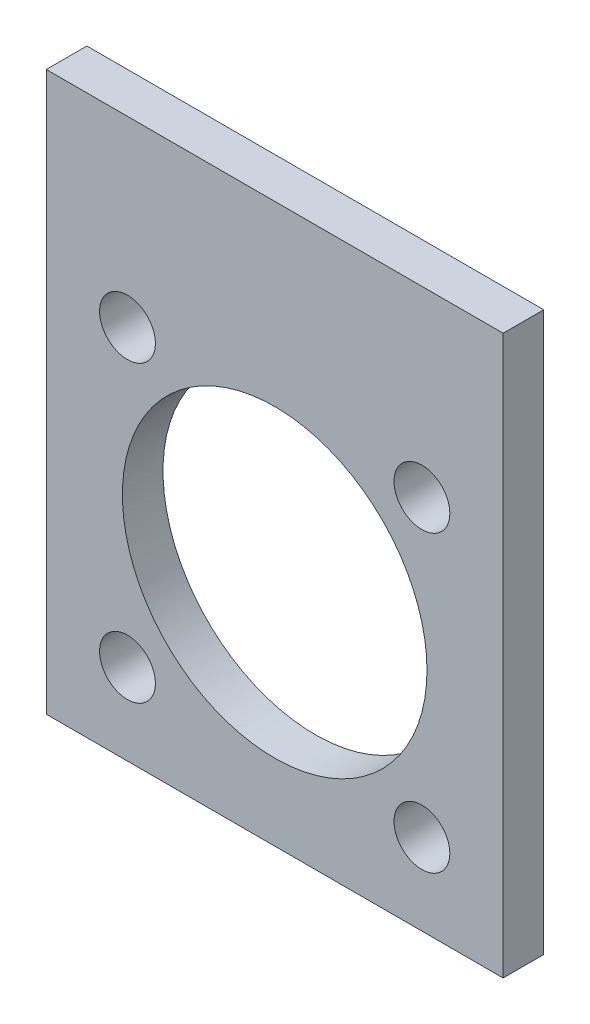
ISO-10303-21;
HEADER;
FILE_DESCRIPTION(('STEP AP214'),'2;1');
FILE_NAME('part.step','',(''),(''),'','','');
FILE_SCHEMA(('AUTOMOTIVE_DESIGN { 1 0 10303 214 1 1 1 1 }'));
ENDSEC;
DATA;
#1=APPLICATION_CONTEXT('core data for automotive mechanical design processes');
#2=APPLICATION_PROTOCOL_DEFINITION('international standard','automotive_design',2000,#1);
#3=PRODUCT_CONTEXT('',#1,'mechanical');
#4=PRODUCT('Part','Part','',(#3));
#5=PRODUCT_RELATED_PRODUCT_CATEGORY('part','',(#4));
#6=PRODUCT_DEFINITION_FORMATION('','',#4);
#7=PRODUCT_DEFINITION_CONTEXT('part definition',#1,'design');
#8=PRODUCT_DEFINITION('design','',#6,#7);
#9=PRODUCT_DEFINITION_SHAPE('','',#8);
#10=(LENGTH_UNIT() NAMED_UNIT(*) SI_UNIT(.MILLI.,.METRE.));
#11=(NAMED_UNIT(*) PLANE_ANGLE_UNIT() SI_UNIT($,.RADIAN.));
#12=(NAMED_UNIT(*) SI_UNIT($,.STERADIAN.) SOLID_ANGLE_UNIT());
#13=UNCERTAINTY_MEASURE_WITH_UNIT(LENGTH_MEASURE(1.E-05),#10,'distance_accuracy_value','');
#14=(GEOMETRIC_REPRESENTATION_CONTEXT(3) GLOBAL_UNCERTAINTY_ASSIGNED_CONTEXT((#13)) GLOBAL_UNIT_ASSIGNED_CONTEXT((#10,
#11,#12)) REPRESENTATION_CONTEXT('',''));
#15=CARTESIAN_POINT('',(0.,0.,0.));
#16=DIRECTION('',(0.,0.,1.));
#17=DIRECTION('',(1.,0.,0.));
#18=AXIS2_PLACEMENT_3D('',#15,#16,#17);
#19=CARTESIAN_POINT('',(-45.,65.0000000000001,8.00000000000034));
#20=DIRECTION('',(0.,0.,1.));
#21=DIRECTION('',(1.,0.,0.));
#22=AXIS2_PLACEMENT_3D('',#19,#20,#21);
#23=PLANE('',#22);
#24=CARTESIAN_POINT('',(-29.,-29.,8.00000000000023));
#25=DIRECTION('',(0.,0.,1.));
#26=DIRECTION('',(1.,0.,0.));
#27=AXIS2_PLACEMENT_3D('',#24,#25,#26);
#28=CIRCLE('',#27,5.5);
#29=CARTESIAN_POINT('',(-23.5,-29.,8.00000000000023));
#30=VERTEX_POINT('',#29);
#31=EDGE_CURVE('E140',#30,#30,#28,.T.);
#32=ORIENTED_EDGE('',*,*,#31,.F.);
#33=EDGE_LOOP('',(#32));
#34=FACE_BOUND('',#33,.T.);
#35=CARTESIAN_POINT('',(-29.,29.0000000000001,7.99999999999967));
#36=DIRECTION('',(0.,0.,1.));
#37=DIRECTION('',(1.,0.,0.));
#38=AXIS2_PLACEMENT_3D('',#35,#36,#37);
#39=CIRCLE('',#38,5.5);
#40=CARTESIAN_POINT('',(-23.5,29.0000000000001,7.99999999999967));
#41=VERTEX_POINT('',#40);
#42=EDGE_CURVE('E154',#41,#41,#39,.T.);
#43=ORIENTED_EDGE('',*,*,#42,.F.);
#44=EDGE_LOOP('',(#43));
#45=FACE_BOUND('',#44,.T.);
#46=DIRECTION('',(0.,-1.,0.));
#47=VECTOR('',#46,1.);
#48=CARTESIAN_POINT('',(-45.,65.0000000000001,8.00000000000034));
#49=LINE('',#48,#47);
#50=CARTESIAN_POINT('',(-45.,65.0000000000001,8.00000000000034));
#51=VERTEX_POINT('',#50);
#52=CARTESIAN_POINT('',(-45.,-45.,7.99999999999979));
#53=VERTEX_POINT('',#52);
#54=EDGE_CURVE('E110',#51,#53,#49,.T.);
#55=ORIENTED_EDGE('',*,*,#54,.T.);
#56=DIRECTION('',(1.,0.,0.));
#57=VECTOR('',#56,1.);
#58=CARTESIAN_POINT('',(-45.,-45.,7.99999999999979));
#59=LINE('',#58,#57);
#60=CARTESIAN_POINT('',(45.,-44.9999999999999,8.00000000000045));
#61=VERTEX_POINT('',#60);
#62=EDGE_CURVE('E95',#53,#61,#59,.T.);
#63=ORIENTED_EDGE('',*,*,#62,.T.);
#64=DIRECTION('',(0.,1.,0.));
#65=VECTOR('',#64,1.);
#66=CARTESIAN_POINT('',(45.,64.9999999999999,8.00000000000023));
#67=LINE('',#66,#65);
#68=CARTESIAN_POINT('',(45.,64.9999999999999,8.00000000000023));
#69=VERTEX_POINT('',#68);
#70=EDGE_CURVE('E61',#61,#69,#67,.T.);
#71=ORIENTED_EDGE('',*,*,#70,.T.);
#72=DIRECTION('',(-1.,0.,0.));
#73=VECTOR('',#72,1.);
#74=CARTESIAN_POINT('',(-45.,65.0000000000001,8.00000000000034));
#75=LINE('',#74,#73);
#76=EDGE_CURVE('E56',#69,#51,#75,.T.);
#77=ORIENTED_EDGE('',*,*,#76,.T.);
#78=EDGE_LOOP('',(#55,#63,#71,#77));
#79=FACE_BOUND('',#78,.T.);
#80=CARTESIAN_POINT('',(0.,-1.38777878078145E-13,7.9999999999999));
#81=DIRECTION('',(0.,0.,1.));
#82=DIRECTION('',(1.,0.,0.));
#83=AXIS2_PLACEMENT_3D('',#80,#81,#82);
#84=CIRCLE('',#83,30.);
#85=CARTESIAN_POINT('',(30.,-1.38777878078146E-13,7.9999999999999));
#86=VERTEX_POINT('',#85);
#87=EDGE_CURVE('E100',#86,#86,#84,.T.);
#88=ORIENTED_EDGE('',*,*,#87,.F.);
#89=EDGE_LOOP('',(#88));
#90=FACE_BOUND('',#89,.T.);
#91=CARTESIAN_POINT('',(29.,29.0000000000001,8.00000000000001));
#92=DIRECTION('',(0.,0.,1.));
#93=DIRECTION('',(1.,0.,0.));
#94=AXIS2_PLACEMENT_3D('',#91,#92,#93);
#95=CIRCLE('',#94,5.5);
#96=CARTESIAN_POINT('',(34.5,29.0000000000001,8.00000000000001));
#97=VERTEX_POINT('',#96);
#98=EDGE_CURVE('E131',#97,#97,#95,.T.);
#99=ORIENTED_EDGE('',*,*,#98,.F.);
#100=EDGE_LOOP('',(#99));
#101=FACE_BOUND('',#100,.T.);
#102=CARTESIAN_POINT('',(29.,-29.0000000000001,8.0000000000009));
#103=DIRECTION('',(0.,0.,1.));
#104=DIRECTION('',(1.,0.,0.));
#105=AXIS2_PLACEMENT_3D('',#102,#103,#104);
#106=CIRCLE('',#105,5.5);
#107=CARTESIAN_POINT('',(34.5,-29.0000000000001,8.0000000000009));
#108=VERTEX_POINT('',#107);
#109=EDGE_CURVE('E134',#108,#108,#106,.T.);
#110=ORIENTED_EDGE('',*,*,#109,.F.);
#111=EDGE_LOOP('',(#110));
#112=FACE_BOUND('',#111,.T.);
#113=ADVANCED_FACE('F41',(#34,#45,#79,#90,#101,#112),#23,.T.);
#114=CARTESIAN_POINT('',(-45.,65.0000000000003,2.22044604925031E-13));
#115=DIRECTION('',(0.,0.,1.));
#116=DIRECTION('',(1.,0.,0.));
#117=AXIS2_PLACEMENT_3D('',#114,#115,#116);
#118=PLANE('',#117);
#119=CARTESIAN_POINT('',(-29.,-29.0000000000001,-1.11022302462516E-13));
#120=DIRECTION('',(0.,0.,1.));
#121=DIRECTION('',(1.,0.,0.));
#122=AXIS2_PLACEMENT_3D('',#119,#120,#121);
#123=CIRCLE('',#122,5.5);
#124=CARTESIAN_POINT('',(-23.5,-29.0000000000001,-1.11022302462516E-13));
#125=VERTEX_POINT('',#124);
#126=EDGE_CURVE('E136',#125,#125,#123,.T.);
#127=ORIENTED_EDGE('',*,*,#126,.T.);
#128=EDGE_LOOP('',(#127));
#129=FACE_BOUND('',#128,.T.);
#130=CARTESIAN_POINT('',(-29.,29.,-4.44089209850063E-13));
#131=DIRECTION('',(0.,0.,1.));
#132=DIRECTION('',(1.,0.,0.));
#133=AXIS2_PLACEMENT_3D('',#130,#131,#132);
#134=CIRCLE('',#133,5.5);
#135=CARTESIAN_POINT('',(-23.5,29.,-4.44089209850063E-13));
#136=VERTEX_POINT('',#135);
#137=EDGE_CURVE('E151',#136,#136,#134,.T.);
#138=ORIENTED_EDGE('',*,*,#137,.T.);
#139=EDGE_LOOP('',(#138));
#140=FACE_BOUND('',#139,.T.);
#141=DIRECTION('',(0.,-1.,0.));
#142=VECTOR('',#141,1.);
#143=CARTESIAN_POINT('',(-45.,65.0000000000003,2.22044604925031E-13));
#144=LINE('',#143,#142);
#145=CARTESIAN_POINT('',(-45.,65.0000000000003,2.22044604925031E-13));
#146=VERTEX_POINT('',#145);
#147=CARTESIAN_POINT('',(-45.,-45.0000000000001,-3.33066907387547E-13));
#148=VERTEX_POINT('',#147);
#149=EDGE_CURVE('E87',#146,#148,#144,.T.);
#150=ORIENTED_EDGE('',*,*,#149,.F.);
#151=DIRECTION('',(-1.,0.,0.));
#152=VECTOR('',#151,1.);
#153=CARTESIAN_POINT('',(-45.,65.0000000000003,2.22044604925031E-13));
#154=LINE('',#153,#152);
#155=CARTESIAN_POINT('',(45.,65.0000000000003,1.11022302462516E-12));
#156=VERTEX_POINT('',#155);
#157=EDGE_CURVE('E108',#156,#146,#154,.T.);
#158=ORIENTED_EDGE('',*,*,#157,.F.);
#159=DIRECTION('',(0.,1.,0.));
#160=VECTOR('',#159,1.);
#161=CARTESIAN_POINT('',(45.,65.0000000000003,1.11022302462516E-12));
#162=LINE('',#161,#160);
#163=CARTESIAN_POINT('',(45.,-45.0000000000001,-2.22044604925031E-13));
#164=VERTEX_POINT('',#163);
#165=EDGE_CURVE('E88',#164,#156,#162,.T.);
#166=ORIENTED_EDGE('',*,*,#165,.F.);
#167=DIRECTION('',(1.,0.,0.));
#168=VECTOR('',#167,1.);
#169=CARTESIAN_POINT('',(-45.,-45.0000000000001,-3.33066907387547E-13));
#170=LINE('',#169,#168);
#171=EDGE_CURVE('E82',#148,#164,#170,.T.);
#172=ORIENTED_EDGE('',*,*,#171,.F.);
#173=EDGE_LOOP('',(#150,#158,#166,#172));
#174=FACE_BOUND('',#173,.T.);
#175=CARTESIAN_POINT('',(0.,0.,0.));
#176=DIRECTION('',(0.,0.,1.));
#177=DIRECTION('',(1.,0.,0.));
#178=AXIS2_PLACEMENT_3D('',#175,#176,#177);
#179=CIRCLE('',#178,30.);
#180=CARTESIAN_POINT('',(30.,0.,0.));
#181=VERTEX_POINT('',#180);
#182=EDGE_CURVE('E103',#181,#181,#179,.T.);
#183=ORIENTED_EDGE('',*,*,#182,.T.);
#184=EDGE_LOOP('',(#183));
#185=FACE_BOUND('',#184,.T.);
#186=CARTESIAN_POINT('',(29.,29.0000000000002,1.11022302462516E-12));
#187=DIRECTION('',(0.,0.,1.));
#188=DIRECTION('',(1.,0.,0.));
#189=AXIS2_PLACEMENT_3D('',#186,#187,#188);
#190=CIRCLE('',#189,5.5);
#191=CARTESIAN_POINT('',(34.5,29.0000000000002,1.11022302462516E-12));
#192=VERTEX_POINT('',#191);
#193=EDGE_CURVE('E147',#192,#192,#190,.T.);
#194=ORIENTED_EDGE('',*,*,#193,.T.);
#195=EDGE_LOOP('',(#194));
#196=FACE_BOUND('',#195,.T.);
#197=CARTESIAN_POINT('',(29.,-28.9999999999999,8.88178419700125E-13));
#198=DIRECTION('',(0.,0.,1.));
#199=DIRECTION('',(1.,0.,0.));
#200=AXIS2_PLACEMENT_3D('',#197,#198,#199);
#201=CIRCLE('',#200,5.5);
#202=CARTESIAN_POINT('',(34.5,-28.9999999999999,8.88178419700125E-13));
#203=VERTEX_POINT('',#202);
#204=EDGE_CURVE('E137',#203,#203,#201,.T.);
#205=ORIENTED_EDGE('',*,*,#204,.T.);
#206=EDGE_LOOP('',(#205));
#207=FACE_BOUND('',#206,.T.);
#208=ADVANCED_FACE('F83',(#129,#140,#174,#185,#196,#207),#118,.F.);
#209=CARTESIAN_POINT('',(-45.,65.0000000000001,8.00000000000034));
#210=DIRECTION('',(1.,0.,0.));
#211=DIRECTION('',(0.,1.,0.));
#212=AXIS2_PLACEMENT_3D('',#209,#210,#211);
#213=PLANE('',#212);
#214=ORIENTED_EDGE('',*,*,#149,.T.);
#215=DIRECTION('',(0.,0.,-1.));
#216=VECTOR('',#215,1.);
#217=CARTESIAN_POINT('',(-45.,-45.,7.99999999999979));
#218=LINE('',#217,#216);
#219=EDGE_CURVE('E11',#53,#148,#218,.T.);
#220=ORIENTED_EDGE('',*,*,#219,.F.);
#221=ORIENTED_EDGE('',*,*,#54,.F.);
#222=DIRECTION('',(0.,0.,-1.));
#223=VECTOR('',#222,1.);
#224=CARTESIAN_POINT('',(-45.,65.0000000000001,8.00000000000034));
#225=LINE('',#224,#223);
#226=EDGE_CURVE('E99',#51,#146,#225,.T.);
#227=ORIENTED_EDGE('',*,*,#226,.T.);
#228=EDGE_LOOP('',(#214,#220,#221,#227));
#229=FACE_BOUND('',#228,.T.);
#230=ADVANCED_FACE('F43',(#229),#213,.F.);
#231=CARTESIAN_POINT('',(-45.,-45.,7.99999999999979));
#232=DIRECTION('',(0.,1.,0.));
#233=DIRECTION('',(-1.,0.,0.));
#234=AXIS2_PLACEMENT_3D('',#231,#232,#233);
#235=PLANE('',#234);
#236=ORIENTED_EDGE('',*,*,#171,.T.);
#237=DIRECTION('',(0.,0.,-1.));
#238=VECTOR('',#237,1.);
#239=CARTESIAN_POINT('',(45.,-44.9999999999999,8.00000000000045));
#240=LINE('',#239,#238);
#241=EDGE_CURVE('E49',#61,#164,#240,.T.);
#242=ORIENTED_EDGE('',*,*,#241,.F.);
#243=ORIENTED_EDGE('',*,*,#62,.F.);
#244=ORIENTED_EDGE('',*,*,#219,.T.);
#245=EDGE_LOOP('',(#236,#242,#243,#244));
#246=FACE_BOUND('',#245,.T.);
#247=ADVANCED_FACE('F94',(#246),#235,.F.);
#248=CARTESIAN_POINT('',(45.,64.9999999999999,8.00000000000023));
#249=DIRECTION('',(-1.,0.,0.));
#250=DIRECTION('',(0.,-1.,0.));
#251=AXIS2_PLACEMENT_3D('',#248,#249,#250);
#252=PLANE('',#251);
#253=ORIENTED_EDGE('',*,*,#165,.T.);
#254=DIRECTION('',(0.,0.,-1.));
#255=VECTOR('',#254,1.);
#256=CARTESIAN_POINT('',(45.,64.9999999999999,8.00000000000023));
#257=LINE('',#256,#255);
#258=EDGE_CURVE('E116',#69,#156,#257,.T.);
#259=ORIENTED_EDGE('',*,*,#258,.F.);
#260=ORIENTED_EDGE('',*,*,#70,.F.);
#261=ORIENTED_EDGE('',*,*,#241,.T.);
#262=EDGE_LOOP('',(#253,#259,#260,#261));
#263=FACE_BOUND('',#262,.T.);
#264=ADVANCED_FACE('F119',(#263),#252,.F.);
#265=CARTESIAN_POINT('',(-45.,65.0000000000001,8.00000000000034));
#266=DIRECTION('',(0.,-1.,0.));
#267=DIRECTION('',(1.,0.,0.));
#268=AXIS2_PLACEMENT_3D('',#265,#266,#267);
#269=PLANE('',#268);
#270=ORIENTED_EDGE('',*,*,#157,.T.);
#271=ORIENTED_EDGE('',*,*,#226,.F.);
#272=ORIENTED_EDGE('',*,*,#76,.F.);
#273=ORIENTED_EDGE('',*,*,#258,.T.);
#274=EDGE_LOOP('',(#270,#271,#272,#273));
#275=FACE_BOUND('',#274,.T.);
#276=ADVANCED_FACE('F121',(#275),#269,.F.);
#277=CARTESIAN_POINT('',(0.,-1.38777878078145E-13,7.9999999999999));
#278=DIRECTION('',(0.,0.,-1.));
#279=DIRECTION('',(-1.,0.,0.));
#280=AXIS2_PLACEMENT_3D('',#277,#278,#279);
#281=CYLINDRICAL_SURFACE('',#280,30.);
#282=ORIENTED_EDGE('',*,*,#87,.T.);
#283=EDGE_LOOP('',(#282));
#284=FACE_BOUND('',#283,.T.);
#285=ORIENTED_EDGE('',*,*,#182,.F.);
#286=EDGE_LOOP('',(#285));
#287=FACE_BOUND('',#286,.T.);
#288=ADVANCED_FACE('F160',(#284,#287),#281,.F.);
#289=CARTESIAN_POINT('',(-29.,29.0000000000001,7.99999999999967));
#290=DIRECTION('',(0.,0.,-1.));
#291=DIRECTION('',(-1.,0.,0.));
#292=AXIS2_PLACEMENT_3D('',#289,#290,#291);
#293=CYLINDRICAL_SURFACE('',#292,5.5);
#294=ORIENTED_EDGE('',*,*,#42,.T.);
#295=EDGE_LOOP('',(#294));
#296=FACE_BOUND('',#295,.T.);
#297=ORIENTED_EDGE('',*,*,#137,.F.);
#298=EDGE_LOOP('',(#297));
#299=FACE_BOUND('',#298,.T.);
#300=ADVANCED_FACE('F162',(#296,#299),#293,.F.);
#301=CARTESIAN_POINT('',(29.,29.0000000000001,8.00000000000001));
#302=DIRECTION('',(0.,0.,-1.));
#303=DIRECTION('',(-1.,0.,0.));
#304=AXIS2_PLACEMENT_3D('',#301,#302,#303);
#305=CYLINDRICAL_SURFACE('',#304,5.5);
#306=ORIENTED_EDGE('',*,*,#98,.T.);
#307=EDGE_LOOP('',(#306));
#308=FACE_BOUND('',#307,.T.);
#309=ORIENTED_EDGE('',*,*,#193,.F.);
#310=EDGE_LOOP('',(#309));
#311=FACE_BOUND('',#310,.T.);
#312=ADVANCED_FACE('F169',(#308,#311),#305,.F.);
#313=CARTESIAN_POINT('',(-29.,-29.,8.00000000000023));
#314=DIRECTION('',(0.,0.,-1.));
#315=DIRECTION('',(-1.,0.,0.));
#316=AXIS2_PLACEMENT_3D('',#313,#314,#315);
#317=CYLINDRICAL_SURFACE('',#316,5.5);
#318=ORIENTED_EDGE('',*,*,#31,.T.);
#319=EDGE_LOOP('',(#318));
#320=FACE_BOUND('',#319,.T.);
#321=ORIENTED_EDGE('',*,*,#126,.F.);
#322=EDGE_LOOP('',(#321));
#323=FACE_BOUND('',#322,.T.);
#324=ADVANCED_FACE('F216',(#320,#323),#317,.F.);
#325=CARTESIAN_POINT('',(29.,-29.0000000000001,8.0000000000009));
#326=DIRECTION('',(0.,0.,-1.));
#327=DIRECTION('',(-1.,0.,0.));
#328=AXIS2_PLACEMENT_3D('',#325,#326,#327);
#329=CYLINDRICAL_SURFACE('',#328,5.5);
#330=ORIENTED_EDGE('',*,*,#109,.T.);
#331=EDGE_LOOP('',(#330));
#332=FACE_BOUND('',#331,.T.);
#333=ORIENTED_EDGE('',*,*,#204,.F.);
#334=EDGE_LOOP('',(#333));
#335=FACE_BOUND('',#334,.T.);
#336=ADVANCED_FACE('F223',(#332,#335),#329,.F.);
#337=CLOSED_SHELL('',(#113,#208,#230,#247,#264,#276,#288,#300,#312,#324,#336));
#338=MANIFOLD_SOLID_BREP('B2',#337);
#339=ADVANCED_BREP_SHAPE_REPRESENTATION('',(#18,#338),#14);
#340=SHAPE_DEFINITION_REPRESENTATION(#9,#339);
ENDSEC;
END-ISO-10303-21;
